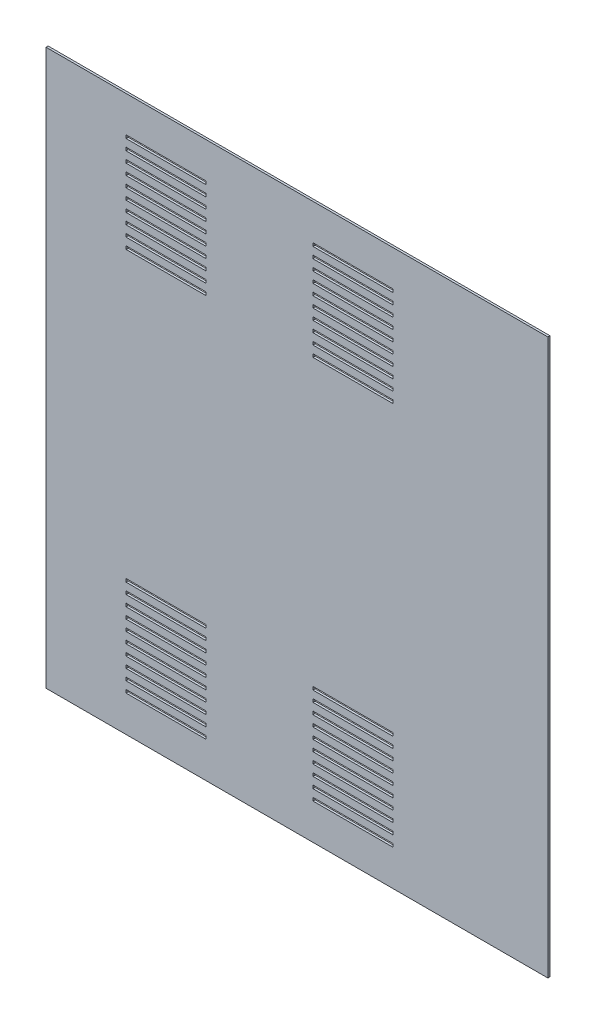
from build123d import *

# Parameters (mm, degrees)
SKETCH_1_W      = 400
SKETCH_1_H      = 520
SKETCH_1_W_2    = 75
SKETCH_1_H_2    = 3
EXTRUDE_1_DEPTH = 2
MOVE_FACE_1_BY  = 70


with BuildPart() as part:
    # Sketch 1 → Extrude 1 (new body)
    with BuildSketch(Plane.XY):
        with Locations((240, 300)):
            Rectangle(SKETCH_1_W, SKETCH_1_H)
        with Locations((327.5, 524.938797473)):
            Rectangle(SKETCH_1_W_2, SKETCH_1_H_2, mode=Mode.SUBTRACT)
        with Locations((152.5, 524.938797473)):
            Rectangle(SKETCH_1_W_2, SKETCH_1_H_2, mode=Mode.SUBTRACT)
        with Locations((152.5, 514.938797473)):
            Rectangle(SKETCH_1_W_2, SKETCH_1_H_2, mode=Mode.SUBTRACT)
        with Locations((327.5, 514.938797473)):
            Rectangle(SKETCH_1_W_2, SKETCH_1_H_2, mode=Mode.SUBTRACT)
        with Locations((152.5, 504.938797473)):
            Rectangle(SKETCH_1_W_2, SKETCH_1_H_2, mode=Mode.SUBTRACT)
        with Locations((327.5, 504.938797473)):
            Rectangle(SKETCH_1_W_2, SKETCH_1_H_2, mode=Mode.SUBTRACT)
        with Locations((152.5, 494.938797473)):
            Rectangle(SKETCH_1_W_2, SKETCH_1_H_2, mode=Mode.SUBTRACT)
        with Locations((327.5, 494.938797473)):
            Rectangle(SKETCH_1_W_2, SKETCH_1_H_2, mode=Mode.SUBTRACT)
        with Locations((152.5, 484.938797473)):
            Rectangle(SKETCH_1_W_2, SKETCH_1_H_2, mode=Mode.SUBTRACT)
        with Locations((327.5, 484.938797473)):
            Rectangle(SKETCH_1_W_2, SKETCH_1_H_2, mode=Mode.SUBTRACT)
        with Locations((152.5, 474.938797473)):
            Rectangle(SKETCH_1_W_2, SKETCH_1_H_2, mode=Mode.SUBTRACT)
        with Locations((327.5, 474.938797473)):
            Rectangle(SKETCH_1_W_2, SKETCH_1_H_2, mode=Mode.SUBTRACT)
        with Locations((152.5, 464.938797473)):
            Rectangle(SKETCH_1_W_2, SKETCH_1_H_2, mode=Mode.SUBTRACT)
        with Locations((327.5, 464.938797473)):
            Rectangle(SKETCH_1_W_2, SKETCH_1_H_2, mode=Mode.SUBTRACT)
        with Locations((152.5, 454.938797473)):
            Rectangle(SKETCH_1_W_2, SKETCH_1_H_2, mode=Mode.SUBTRACT)
        with Locations((327.5, 454.938797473)):
            Rectangle(SKETCH_1_W_2, SKETCH_1_H_2, mode=Mode.SUBTRACT)
        with Locations((152.5, 444.938797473)):
            Rectangle(SKETCH_1_W_2, SKETCH_1_H_2, mode=Mode.SUBTRACT)
        with Locations((327.5, 444.938797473)):
            Rectangle(SKETCH_1_W_2, SKETCH_1_H_2, mode=Mode.SUBTRACT)
        with Locations((152.5, 434.938797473)):
            Rectangle(SKETCH_1_W_2, SKETCH_1_H_2, mode=Mode.SUBTRACT)
        with Locations((327.5, 434.938797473)):
            Rectangle(SKETCH_1_W_2, SKETCH_1_H_2, mode=Mode.SUBTRACT)
        with Locations((327.5, 165.061202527)):
            Rectangle(SKETCH_1_W_2, SKETCH_1_H_2, mode=Mode.SUBTRACT)
        with Locations((152.5, 165.061202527)):
            Rectangle(SKETCH_1_W_2, SKETCH_1_H_2, mode=Mode.SUBTRACT)
        with Locations((327.5, 155.061202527)):
            Rectangle(SKETCH_1_W_2, SKETCH_1_H_2, mode=Mode.SUBTRACT)
        with Locations((152.5, 155.061202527)):
            Rectangle(SKETCH_1_W_2, SKETCH_1_H_2, mode=Mode.SUBTRACT)
        with Locations((327.5, 145.061202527)):
            Rectangle(SKETCH_1_W_2, SKETCH_1_H_2, mode=Mode.SUBTRACT)
        with Locations((152.5, 145.061202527)):
            Rectangle(SKETCH_1_W_2, SKETCH_1_H_2, mode=Mode.SUBTRACT)
        with Locations((327.5, 135.061202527)):
            Rectangle(SKETCH_1_W_2, SKETCH_1_H_2, mode=Mode.SUBTRACT)
        with Locations((152.5, 135.061202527)):
            Rectangle(SKETCH_1_W_2, SKETCH_1_H_2, mode=Mode.SUBTRACT)
        with Locations((327.5, 125.061202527)):
            Rectangle(SKETCH_1_W_2, SKETCH_1_H_2, mode=Mode.SUBTRACT)
        with Locations((152.5, 125.061202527)):
            Rectangle(SKETCH_1_W_2, SKETCH_1_H_2, mode=Mode.SUBTRACT)
        with Locations((327.5, 115.061202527)):
            Rectangle(SKETCH_1_W_2, SKETCH_1_H_2, mode=Mode.SUBTRACT)
        with Locations((152.5, 115.061202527)):
            Rectangle(SKETCH_1_W_2, SKETCH_1_H_2, mode=Mode.SUBTRACT)
        with Locations((327.5, 105.061202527)):
            Rectangle(SKETCH_1_W_2, SKETCH_1_H_2, mode=Mode.SUBTRACT)
        with Locations((152.5, 105.061202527)):
            Rectangle(SKETCH_1_W_2, SKETCH_1_H_2, mode=Mode.SUBTRACT)
        with Locations((327.5, 95.061202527)):
            Rectangle(SKETCH_1_W_2, SKETCH_1_H_2, mode=Mode.SUBTRACT)
        with Locations((152.5, 95.061202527)):
            Rectangle(SKETCH_1_W_2, SKETCH_1_H_2, mode=Mode.SUBTRACT)
        with Locations((327.5, 85.061202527)):
            Rectangle(SKETCH_1_W_2, SKETCH_1_H_2, mode=Mode.SUBTRACT)
        with Locations((152.5, 85.061202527)):
            Rectangle(SKETCH_1_W_2, SKETCH_1_H_2, mode=Mode.SUBTRACT)
        with Locations((327.5, 75.061202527)):
            Rectangle(SKETCH_1_W_2, SKETCH_1_H_2, mode=Mode.SUBTRACT)
        with Locations((152.5, 75.061202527)):
            Rectangle(SKETCH_1_W_2, SKETCH_1_H_2, mode=Mode.SUBTRACT)
    extrude(amount=-EXTRUDE_1_DEPTH)

    # Move Face 1: a face moved outward by 70.0
    extrude(part.faces().sort_by_distance((440, 300, -1))[0], amount=MOVE_FACE_1_BY, dir=(1, 0, 0))


solid = part.part
